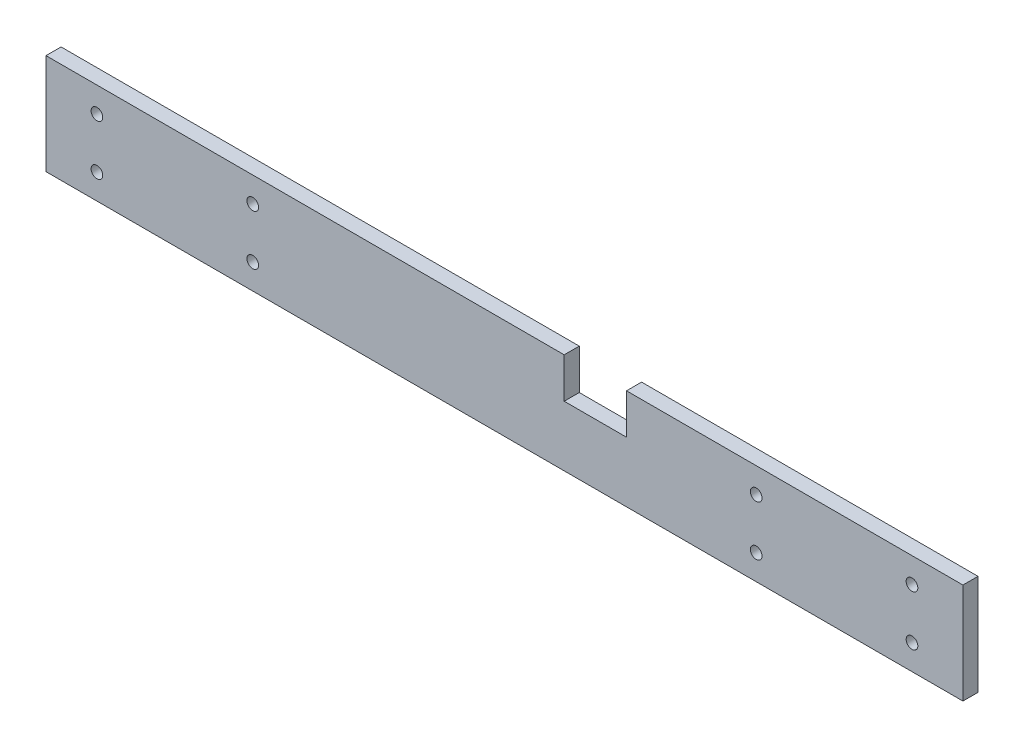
ISO-10303-21;
HEADER;
FILE_DESCRIPTION(('STEP AP214'),'2;1');
FILE_NAME('part.step','',(''),(''),'','','');
FILE_SCHEMA(('AUTOMOTIVE_DESIGN { 1 0 10303 214 1 1 1 1 }'));
ENDSEC;
DATA;
#1=APPLICATION_CONTEXT('core data for automotive mechanical design processes');
#2=APPLICATION_PROTOCOL_DEFINITION('international standard','automotive_design',2000,#1);
#3=PRODUCT_CONTEXT('',#1,'mechanical');
#4=PRODUCT('Part','Part','',(#3));
#5=PRODUCT_RELATED_PRODUCT_CATEGORY('part','',(#4));
#6=PRODUCT_DEFINITION_FORMATION('','',#4);
#7=PRODUCT_DEFINITION_CONTEXT('part definition',#1,'design');
#8=PRODUCT_DEFINITION('design','',#6,#7);
#9=PRODUCT_DEFINITION_SHAPE('','',#8);
#10=(LENGTH_UNIT() NAMED_UNIT(*) SI_UNIT(.MILLI.,.METRE.));
#11=(NAMED_UNIT(*) PLANE_ANGLE_UNIT() SI_UNIT($,.RADIAN.));
#12=(NAMED_UNIT(*) SI_UNIT($,.STERADIAN.) SOLID_ANGLE_UNIT());
#13=UNCERTAINTY_MEASURE_WITH_UNIT(LENGTH_MEASURE(1.E-05),#10,'distance_accuracy_value','');
#14=(GEOMETRIC_REPRESENTATION_CONTEXT(3) GLOBAL_UNCERTAINTY_ASSIGNED_CONTEXT((#13)) GLOBAL_UNIT_ASSIGNED_CONTEXT((#10,
#11,#12)) REPRESENTATION_CONTEXT('',''));
#15=CARTESIAN_POINT('',(0.,0.,0.));
#16=DIRECTION('',(0.,0.,1.));
#17=DIRECTION('',(1.,0.,0.));
#18=AXIS2_PLACEMENT_3D('',#15,#16,#17);
#19=CARTESIAN_POINT('',(-144.8054,15.875,-4.7625));
#20=DIRECTION('',(0.,1.,0.));
#21=DIRECTION('',(0.,0.,1.));
#22=AXIS2_PLACEMENT_3D('',#19,#20,#21);
#23=PLANE('',#22);
#24=DIRECTION('',(-1.,0.,0.));
#25=VECTOR('',#24,1.);
#26=CARTESIAN_POINT('',(-144.8054,15.875,-4.7625));
#27=LINE('',#26,#25);
#28=CARTESIAN_POINT('',(144.8054,15.875,-4.7625));
#29=VERTEX_POINT('',#28);
#30=CARTESIAN_POINT('',(38.55085,15.875,-4.7625));
#31=VERTEX_POINT('',#30);
#32=EDGE_CURVE('E184',#29,#31,#27,.T.);
#33=ORIENTED_EDGE('',*,*,#32,.T.);
#34=DIRECTION('',(0.,0.,1.));
#35=VECTOR('',#34,1.);
#36=CARTESIAN_POINT('',(38.55085,15.875,-374.946748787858));
#37=LINE('',#36,#35);
#38=CARTESIAN_POINT('',(38.55085,15.875,0.));
#39=VERTEX_POINT('',#38);
#40=EDGE_CURVE('E124',#31,#39,#37,.T.);
#41=ORIENTED_EDGE('',*,*,#40,.T.);
#42=DIRECTION('',(-1.,0.,0.));
#43=VECTOR('',#42,1.);
#44=CARTESIAN_POINT('',(-144.8054,15.875,0.));
#45=LINE('',#44,#43);
#46=CARTESIAN_POINT('',(144.8054,15.875,0.));
#47=VERTEX_POINT('',#46);
#48=EDGE_CURVE('E197',#47,#39,#45,.T.);
#49=ORIENTED_EDGE('',*,*,#48,.F.);
#50=DIRECTION('',(0.,0.,1.));
#51=VECTOR('',#50,1.);
#52=CARTESIAN_POINT('',(144.8054,15.875,-4.7625));
#53=LINE('',#52,#51);
#54=EDGE_CURVE('E193',#29,#47,#53,.T.);
#55=ORIENTED_EDGE('',*,*,#54,.F.);
#56=EDGE_LOOP('',(#33,#41,#49,#55));
#57=FACE_BOUND('',#56,.T.);
#58=ADVANCED_FACE('F38',(#57),#23,.T.);
#59=CARTESIAN_POINT('',(0.,0.,-4.7625));
#60=DIRECTION('',(0.,0.,-1.));
#61=DIRECTION('',(-1.,0.,0.));
#62=AXIS2_PLACEMENT_3D('',#59,#60,#61);
#63=PLANE('',#62);
#64=CARTESIAN_POINT('',(-128.72085,-7.93750000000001,-4.7625));
#65=DIRECTION('',(0.,0.,-1.));
#66=DIRECTION('',(-1.,0.,0.));
#67=AXIS2_PLACEMENT_3D('',#64,#65,#66);
#68=CIRCLE('',#67,1.84150000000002);
#69=CARTESIAN_POINT('',(-130.56235,-7.93750000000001,-4.7625));
#70=VERTEX_POINT('',#69);
#71=EDGE_CURVE('E153',#70,#70,#68,.T.);
#72=ORIENTED_EDGE('',*,*,#71,.F.);
#73=EDGE_LOOP('',(#72));
#74=FACE_BOUND('',#73,.T.);
#75=CARTESIAN_POINT('',(128.72085,-7.93750000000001,-4.7625));
#76=DIRECTION('',(0.,0.,-1.));
#77=DIRECTION('',(1.,0.,0.));
#78=AXIS2_PLACEMENT_3D('',#75,#76,#77);
#79=CIRCLE('',#78,1.84150000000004);
#80=CARTESIAN_POINT('',(126.87935,-7.93750000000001,-4.7625));
#81=VERTEX_POINT('',#80);
#82=EDGE_CURVE('E159',#81,#81,#79,.T.);
#83=ORIENTED_EDGE('',*,*,#82,.F.);
#84=EDGE_LOOP('',(#83));
#85=FACE_BOUND('',#84,.T.);
#86=CARTESIAN_POINT('',(128.72085,7.93749999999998,-4.7625));
#87=DIRECTION('',(0.,0.,-1.));
#88=DIRECTION('',(1.,0.,0.));
#89=AXIS2_PLACEMENT_3D('',#86,#87,#88);
#90=CIRCLE('',#89,1.84150000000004);
#91=CARTESIAN_POINT('',(126.87935,7.93749999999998,-4.7625));
#92=VERTEX_POINT('',#91);
#93=EDGE_CURVE('E165',#92,#92,#90,.T.);
#94=ORIENTED_EDGE('',*,*,#93,.F.);
#95=EDGE_LOOP('',(#94));
#96=FACE_BOUND('',#95,.T.);
#97=CARTESIAN_POINT('',(-79.5083499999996,7.93749999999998,-4.7625));
#98=DIRECTION('',(0.,0.,-1.));
#99=DIRECTION('',(-1.,0.,0.));
#100=AXIS2_PLACEMENT_3D('',#97,#98,#99);
#101=CIRCLE('',#100,1.84150000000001);
#102=CARTESIAN_POINT('',(-81.3498499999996,7.93749999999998,-4.7625));
#103=VERTEX_POINT('',#102);
#104=EDGE_CURVE('E134',#103,#103,#101,.T.);
#105=ORIENTED_EDGE('',*,*,#104,.F.);
#106=EDGE_LOOP('',(#105));
#107=FACE_BOUND('',#106,.T.);
#108=CARTESIAN_POINT('',(-79.5083499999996,-7.93750000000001,-4.7625));
#109=DIRECTION('',(0.,0.,-1.));
#110=DIRECTION('',(-1.,0.,0.));
#111=AXIS2_PLACEMENT_3D('',#108,#109,#110);
#112=CIRCLE('',#111,1.84149999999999);
#113=CARTESIAN_POINT('',(-81.3498499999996,-7.93750000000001,-4.7625));
#114=VERTEX_POINT('',#113);
#115=EDGE_CURVE('E135',#114,#114,#112,.T.);
#116=ORIENTED_EDGE('',*,*,#115,.F.);
#117=EDGE_LOOP('',(#116));
#118=FACE_BOUND('',#117,.T.);
#119=CARTESIAN_POINT('',(79.5083499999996,-7.93750000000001,-4.7625));
#120=DIRECTION('',(0.,0.,-1.));
#121=DIRECTION('',(1.,0.,0.));
#122=AXIS2_PLACEMENT_3D('',#119,#120,#121);
#123=CIRCLE('',#122,1.84149999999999);
#124=CARTESIAN_POINT('',(77.6668499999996,-7.93750000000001,-4.7625));
#125=VERTEX_POINT('',#124);
#126=EDGE_CURVE('E141',#125,#125,#123,.T.);
#127=ORIENTED_EDGE('',*,*,#126,.F.);
#128=EDGE_LOOP('',(#127));
#129=FACE_BOUND('',#128,.T.);
#130=CARTESIAN_POINT('',(79.5083499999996,7.93749999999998,-4.7625));
#131=DIRECTION('',(0.,0.,-1.));
#132=DIRECTION('',(1.,0.,0.));
#133=AXIS2_PLACEMENT_3D('',#130,#131,#132);
#134=CIRCLE('',#133,1.84150000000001);
#135=CARTESIAN_POINT('',(77.6668499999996,7.93749999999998,-4.7625));
#136=VERTEX_POINT('',#135);
#137=EDGE_CURVE('E130',#136,#136,#134,.T.);
#138=ORIENTED_EDGE('',*,*,#137,.F.);
#139=EDGE_LOOP('',(#138));
#140=FACE_BOUND('',#139,.T.);
#141=CARTESIAN_POINT('',(-128.72085,7.93749999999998,-4.7625));
#142=DIRECTION('',(0.,0.,-1.));
#143=DIRECTION('',(-1.,0.,0.));
#144=AXIS2_PLACEMENT_3D('',#141,#142,#143);
#145=CIRCLE('',#144,1.84150000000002);
#146=CARTESIAN_POINT('',(-130.56235,7.93749999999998,-4.7625));
#147=VERTEX_POINT('',#146);
#148=EDGE_CURVE('E152',#147,#147,#145,.T.);
#149=ORIENTED_EDGE('',*,*,#148,.F.);
#150=EDGE_LOOP('',(#149));
#151=FACE_BOUND('',#150,.T.);
#152=DIRECTION('',(1.,0.,0.));
#153=VECTOR('',#152,1.);
#154=CARTESIAN_POINT('',(0.,3.17499999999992,-4.7625));
#155=LINE('',#154,#153);
#156=CARTESIAN_POINT('',(18.86585,3.17499999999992,-4.7625));
#157=VERTEX_POINT('',#156);
#158=CARTESIAN_POINT('',(38.55085,3.17499999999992,-4.7625));
#159=VERTEX_POINT('',#158);
#160=EDGE_CURVE('E53',#157,#159,#155,.T.);
#161=ORIENTED_EDGE('',*,*,#160,.T.);
#162=DIRECTION('',(0.,1.,0.));
#163=VECTOR('',#162,1.);
#164=CARTESIAN_POINT('',(38.55085,0.,-4.7625));
#165=LINE('',#164,#163);
#166=EDGE_CURVE('E128',#159,#31,#165,.T.);
#167=ORIENTED_EDGE('',*,*,#166,.T.);
#168=ORIENTED_EDGE('',*,*,#32,.F.);
#169=DIRECTION('',(0.,1.,0.));
#170=VECTOR('',#169,1.);
#171=CARTESIAN_POINT('',(144.8054,-15.875,-4.7625));
#172=LINE('',#171,#170);
#173=CARTESIAN_POINT('',(144.8054,-15.875,-4.7625));
#174=VERTEX_POINT('',#173);
#175=EDGE_CURVE('E179',#174,#29,#172,.T.);
#176=ORIENTED_EDGE('',*,*,#175,.F.);
#177=DIRECTION('',(1.,0.,0.));
#178=VECTOR('',#177,1.);
#179=CARTESIAN_POINT('',(-144.8054,-15.875,-4.7625));
#180=LINE('',#179,#178);
#181=CARTESIAN_POINT('',(-144.8054,-15.875,-4.7625));
#182=VERTEX_POINT('',#181);
#183=EDGE_CURVE('E190',#182,#174,#180,.T.);
#184=ORIENTED_EDGE('',*,*,#183,.F.);
#185=DIRECTION('',(0.,-1.,0.));
#186=VECTOR('',#185,1.);
#187=CARTESIAN_POINT('',(-144.8054,-15.875,-4.7625));
#188=LINE('',#187,#186);
#189=CARTESIAN_POINT('',(-144.8054,15.875,-4.7625));
#190=VERTEX_POINT('',#189);
#191=EDGE_CURVE('E187',#190,#182,#188,.T.);
#192=ORIENTED_EDGE('',*,*,#191,.F.);
#193=CARTESIAN_POINT('',(18.86585,15.875,-4.7625));
#194=VERTEX_POINT('',#193);
#195=EDGE_CURVE('E182',#194,#190,#27,.T.);
#196=ORIENTED_EDGE('',*,*,#195,.F.);
#197=DIRECTION('',(0.,-1.,0.));
#198=VECTOR('',#197,1.);
#199=CARTESIAN_POINT('',(18.86585,0.,-4.7625));
#200=LINE('',#199,#198);
#201=EDGE_CURVE('E58',#194,#157,#200,.T.);
#202=ORIENTED_EDGE('',*,*,#201,.T.);
#203=EDGE_LOOP('',(#161,#167,#168,#176,#184,#192,#196,#202));
#204=FACE_BOUND('',#203,.T.);
#205=ADVANCED_FACE('F222',(#74,#85,#96,#107,#118,#129,#140,#151,#204),#63,.T.);
#206=CARTESIAN_POINT('',(0.,0.,0.));
#207=DIRECTION('',(0.,0.,-1.));
#208=DIRECTION('',(-1.,0.,0.));
#209=AXIS2_PLACEMENT_3D('',#206,#207,#208);
#210=PLANE('',#209);
#211=CARTESIAN_POINT('',(-128.72085,7.93749999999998,0.));
#212=DIRECTION('',(0.,0.,-1.));
#213=DIRECTION('',(-1.,0.,0.));
#214=AXIS2_PLACEMENT_3D('',#211,#212,#213);
#215=CIRCLE('',#214,1.84150000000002);
#216=CARTESIAN_POINT('',(-130.56235,7.93749999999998,0.));
#217=VERTEX_POINT('',#216);
#218=EDGE_CURVE('E173',#217,#217,#215,.T.);
#219=ORIENTED_EDGE('',*,*,#218,.T.);
#220=EDGE_LOOP('',(#219));
#221=FACE_BOUND('',#220,.T.);
#222=CARTESIAN_POINT('',(79.5083499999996,7.93749999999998,0.));
#223=DIRECTION('',(0.,0.,-1.));
#224=DIRECTION('',(1.,0.,0.));
#225=AXIS2_PLACEMENT_3D('',#222,#223,#224);
#226=CIRCLE('',#225,1.84150000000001);
#227=CARTESIAN_POINT('',(77.6668499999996,7.93749999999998,0.));
#228=VERTEX_POINT('',#227);
#229=EDGE_CURVE('E144',#228,#228,#226,.T.);
#230=ORIENTED_EDGE('',*,*,#229,.T.);
#231=EDGE_LOOP('',(#230));
#232=FACE_BOUND('',#231,.T.);
#233=CARTESIAN_POINT('',(79.5083499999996,-7.93750000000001,0.));
#234=DIRECTION('',(0.,0.,-1.));
#235=DIRECTION('',(1.,0.,0.));
#236=AXIS2_PLACEMENT_3D('',#233,#234,#235);
#237=CIRCLE('',#236,1.84149999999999);
#238=CARTESIAN_POINT('',(77.6668499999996,-7.93750000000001,0.));
#239=VERTEX_POINT('',#238);
#240=EDGE_CURVE('E138',#239,#239,#237,.T.);
#241=ORIENTED_EDGE('',*,*,#240,.T.);
#242=EDGE_LOOP('',(#241));
#243=FACE_BOUND('',#242,.T.);
#244=CARTESIAN_POINT('',(-79.5083499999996,-7.93750000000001,0.));
#245=DIRECTION('',(0.,0.,-1.));
#246=DIRECTION('',(-1.,0.,0.));
#247=AXIS2_PLACEMENT_3D('',#244,#245,#246);
#248=CIRCLE('',#247,1.84149999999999);
#249=CARTESIAN_POINT('',(-81.3498499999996,-7.93750000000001,0.));
#250=VERTEX_POINT('',#249);
#251=EDGE_CURVE('E131',#250,#250,#248,.T.);
#252=ORIENTED_EDGE('',*,*,#251,.T.);
#253=EDGE_LOOP('',(#252));
#254=FACE_BOUND('',#253,.T.);
#255=CARTESIAN_POINT('',(-79.5083499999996,7.93749999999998,0.));
#256=DIRECTION('',(0.,0.,-1.));
#257=DIRECTION('',(-1.,0.,0.));
#258=AXIS2_PLACEMENT_3D('',#255,#256,#257);
#259=CIRCLE('',#258,1.84150000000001);
#260=CARTESIAN_POINT('',(-81.3498499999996,7.93749999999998,0.));
#261=VERTEX_POINT('',#260);
#262=EDGE_CURVE('E168',#261,#261,#259,.T.);
#263=ORIENTED_EDGE('',*,*,#262,.T.);
#264=EDGE_LOOP('',(#263));
#265=FACE_BOUND('',#264,.T.);
#266=CARTESIAN_POINT('',(128.72085,7.93749999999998,0.));
#267=DIRECTION('',(0.,0.,-1.));
#268=DIRECTION('',(1.,0.,0.));
#269=AXIS2_PLACEMENT_3D('',#266,#267,#268);
#270=CIRCLE('',#269,1.84150000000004);
#271=CARTESIAN_POINT('',(126.87935,7.93749999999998,0.));
#272=VERTEX_POINT('',#271);
#273=EDGE_CURVE('E162',#272,#272,#270,.T.);
#274=ORIENTED_EDGE('',*,*,#273,.T.);
#275=EDGE_LOOP('',(#274));
#276=FACE_BOUND('',#275,.T.);
#277=CARTESIAN_POINT('',(128.72085,-7.93750000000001,0.));
#278=DIRECTION('',(0.,0.,-1.));
#279=DIRECTION('',(1.,0.,0.));
#280=AXIS2_PLACEMENT_3D('',#277,#278,#279);
#281=CIRCLE('',#280,1.84150000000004);
#282=CARTESIAN_POINT('',(126.87935,-7.93750000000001,0.));
#283=VERTEX_POINT('',#282);
#284=EDGE_CURVE('E156',#283,#283,#281,.T.);
#285=ORIENTED_EDGE('',*,*,#284,.T.);
#286=EDGE_LOOP('',(#285));
#287=FACE_BOUND('',#286,.T.);
#288=CARTESIAN_POINT('',(-128.72085,-7.93750000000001,0.));
#289=DIRECTION('',(0.,0.,-1.));
#290=DIRECTION('',(-1.,0.,0.));
#291=AXIS2_PLACEMENT_3D('',#288,#289,#290);
#292=CIRCLE('',#291,1.84150000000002);
#293=CARTESIAN_POINT('',(-130.56235,-7.93750000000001,0.));
#294=VERTEX_POINT('',#293);
#295=EDGE_CURVE('E149',#294,#294,#292,.T.);
#296=ORIENTED_EDGE('',*,*,#295,.T.);
#297=EDGE_LOOP('',(#296));
#298=FACE_BOUND('',#297,.T.);
#299=DIRECTION('',(0.,1.,0.));
#300=VECTOR('',#299,1.);
#301=CARTESIAN_POINT('',(38.55085,0.,0.));
#302=LINE('',#301,#300);
#303=CARTESIAN_POINT('',(38.55085,3.17499999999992,0.));
#304=VERTEX_POINT('',#303);
#305=EDGE_CURVE('E11',#304,#39,#302,.T.);
#306=ORIENTED_EDGE('',*,*,#305,.F.);
#307=DIRECTION('',(1.,0.,0.));
#308=VECTOR('',#307,1.);
#309=CARTESIAN_POINT('',(0.,3.17499999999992,0.));
#310=LINE('',#309,#308);
#311=CARTESIAN_POINT('',(18.86585,3.17499999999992,0.));
#312=VERTEX_POINT('',#311);
#313=EDGE_CURVE('E46',#312,#304,#310,.T.);
#314=ORIENTED_EDGE('',*,*,#313,.F.);
#315=DIRECTION('',(0.,-1.,0.));
#316=VECTOR('',#315,1.);
#317=CARTESIAN_POINT('',(18.86585,0.,0.));
#318=LINE('',#317,#316);
#319=CARTESIAN_POINT('',(18.86585,15.875,0.));
#320=VERTEX_POINT('',#319);
#321=EDGE_CURVE('E103',#320,#312,#318,.T.);
#322=ORIENTED_EDGE('',*,*,#321,.F.);
#323=CARTESIAN_POINT('',(-144.8054,15.875,0.));
#324=VERTEX_POINT('',#323);
#325=EDGE_CURVE('E196',#320,#324,#45,.T.);
#326=ORIENTED_EDGE('',*,*,#325,.T.);
#327=DIRECTION('',(0.,-1.,0.));
#328=VECTOR('',#327,1.);
#329=CARTESIAN_POINT('',(-144.8054,-15.875,0.));
#330=LINE('',#329,#328);
#331=CARTESIAN_POINT('',(-144.8054,-15.875,0.));
#332=VERTEX_POINT('',#331);
#333=EDGE_CURVE('E199',#324,#332,#330,.T.);
#334=ORIENTED_EDGE('',*,*,#333,.T.);
#335=DIRECTION('',(1.,0.,0.));
#336=VECTOR('',#335,1.);
#337=CARTESIAN_POINT('',(-144.8054,-15.875,0.));
#338=LINE('',#337,#336);
#339=CARTESIAN_POINT('',(144.8054,-15.875,0.));
#340=VERTEX_POINT('',#339);
#341=EDGE_CURVE('E183',#332,#340,#338,.T.);
#342=ORIENTED_EDGE('',*,*,#341,.T.);
#343=DIRECTION('',(0.,1.,0.));
#344=VECTOR('',#343,1.);
#345=CARTESIAN_POINT('',(144.8054,-15.875,0.));
#346=LINE('',#345,#344);
#347=EDGE_CURVE('E176',#340,#47,#346,.T.);
#348=ORIENTED_EDGE('',*,*,#347,.T.);
#349=ORIENTED_EDGE('',*,*,#48,.T.);
#350=EDGE_LOOP('',(#306,#314,#322,#326,#334,#342,#348,#349));
#351=FACE_BOUND('',#350,.T.);
#352=ADVANCED_FACE('F102',(#221,#232,#243,#254,#265,#276,#287,#298,#351),#210,.F.);
#353=CARTESIAN_POINT('',(144.8054,-15.875,-4.7625));
#354=DIRECTION('',(1.,0.,0.));
#355=DIRECTION('',(0.,0.,-1.));
#356=AXIS2_PLACEMENT_3D('',#353,#354,#355);
#357=PLANE('',#356);
#358=ORIENTED_EDGE('',*,*,#347,.F.);
#359=DIRECTION('',(0.,0.,1.));
#360=VECTOR('',#359,1.);
#361=CARTESIAN_POINT('',(144.8054,-15.875,-4.7625));
#362=LINE('',#361,#360);
#363=EDGE_CURVE('E116',#174,#340,#362,.T.);
#364=ORIENTED_EDGE('',*,*,#363,.F.);
#365=ORIENTED_EDGE('',*,*,#175,.T.);
#366=ORIENTED_EDGE('',*,*,#54,.T.);
#367=EDGE_LOOP('',(#358,#364,#365,#366));
#368=FACE_BOUND('',#367,.T.);
#369=ADVANCED_FACE('F40',(#368),#357,.T.);
#370=CARTESIAN_POINT('',(-144.8054,-15.875,-4.7625));
#371=DIRECTION('',(0.,-1.,0.));
#372=DIRECTION('',(0.,0.,-1.));
#373=AXIS2_PLACEMENT_3D('',#370,#371,#372);
#374=PLANE('',#373);
#375=ORIENTED_EDGE('',*,*,#341,.F.);
#376=DIRECTION('',(0.,0.,1.));
#377=VECTOR('',#376,1.);
#378=CARTESIAN_POINT('',(-144.8054,-15.875,-4.7625));
#379=LINE('',#378,#377);
#380=EDGE_CURVE('E205',#182,#332,#379,.T.);
#381=ORIENTED_EDGE('',*,*,#380,.F.);
#382=ORIENTED_EDGE('',*,*,#183,.T.);
#383=ORIENTED_EDGE('',*,*,#363,.T.);
#384=EDGE_LOOP('',(#375,#381,#382,#383));
#385=FACE_BOUND('',#384,.T.);
#386=ADVANCED_FACE('F220',(#385),#374,.T.);
#387=CARTESIAN_POINT('',(-144.8054,-15.875,-4.7625));
#388=DIRECTION('',(-1.,0.,0.));
#389=DIRECTION('',(0.,0.,1.));
#390=AXIS2_PLACEMENT_3D('',#387,#388,#389);
#391=PLANE('',#390);
#392=ORIENTED_EDGE('',*,*,#333,.F.);
#393=DIRECTION('',(0.,0.,1.));
#394=VECTOR('',#393,1.);
#395=CARTESIAN_POINT('',(-144.8054,15.875,-4.7625));
#396=LINE('',#395,#394);
#397=EDGE_CURVE('E207',#190,#324,#396,.T.);
#398=ORIENTED_EDGE('',*,*,#397,.F.);
#399=ORIENTED_EDGE('',*,*,#191,.T.);
#400=ORIENTED_EDGE('',*,*,#380,.T.);
#401=EDGE_LOOP('',(#392,#398,#399,#400));
#402=FACE_BOUND('',#401,.T.);
#403=ADVANCED_FACE('F248',(#402),#391,.T.);
#404=DIRECTION('',(0.,0.,1.));
#405=VECTOR('',#404,1.);
#406=CARTESIAN_POINT('',(18.86585,15.8749999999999,-374.946748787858));
#407=LINE('',#406,#405);
#408=EDGE_CURVE('E115',#194,#320,#407,.T.);
#409=ORIENTED_EDGE('',*,*,#408,.F.);
#410=ORIENTED_EDGE('',*,*,#195,.T.);
#411=ORIENTED_EDGE('',*,*,#397,.T.);
#412=ORIENTED_EDGE('',*,*,#325,.F.);
#413=EDGE_LOOP('',(#409,#410,#411,#412));
#414=FACE_BOUND('',#413,.T.);
#415=ADVANCED_FACE('F239',(#414),#23,.T.);
#416=CARTESIAN_POINT('',(-128.72085,7.93749999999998,0.));
#417=DIRECTION('',(0.,0.,-1.));
#418=DIRECTION('',(-1.,0.,0.));
#419=AXIS2_PLACEMENT_3D('',#416,#417,#418);
#420=CYLINDRICAL_SURFACE('',#419,1.84150000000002);
#421=CARTESIAN_POINT('',(-130.56235,7.93749999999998,0.));
#422=CARTESIAN_POINT('',(-130.56235,7.93749999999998,-0.049609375));
#423=CARTESIAN_POINT('',(-130.56235,7.93749999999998,-0.09921875));
#424=CARTESIAN_POINT('',(-130.56235,7.93749999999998,-0.1984375));
#425=CARTESIAN_POINT('',(-130.56235,7.93749999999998,-0.248046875));
#426=CARTESIAN_POINT('',(-130.56235,7.93749999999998,-0.347265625));
#427=CARTESIAN_POINT('',(-130.56235,7.93749999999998,-0.396875));
#428=CARTESIAN_POINT('',(-130.56235,7.93749999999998,-0.49609375));
#429=CARTESIAN_POINT('',(-130.56235,7.93749999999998,-0.545703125));
#430=CARTESIAN_POINT('',(-130.56235,7.93749999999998,-0.644921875));
#431=CARTESIAN_POINT('',(-130.56235,7.93749999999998,-0.69453125));
#432=CARTESIAN_POINT('',(-130.56235,7.93749999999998,-0.79375));
#433=CARTESIAN_POINT('',(-130.56235,7.93749999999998,-0.843359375));
#434=CARTESIAN_POINT('',(-130.56235,7.93749999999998,-0.942578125));
#435=CARTESIAN_POINT('',(-130.56235,7.93749999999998,-0.9921875));
#436=CARTESIAN_POINT('',(-130.56235,7.93749999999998,-1.09140625));
#437=CARTESIAN_POINT('',(-130.56235,7.93749999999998,-1.141015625));
#438=CARTESIAN_POINT('',(-130.56235,7.93749999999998,-1.240234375));
#439=CARTESIAN_POINT('',(-130.56235,7.93749999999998,-1.28984375));
#440=CARTESIAN_POINT('',(-130.56235,7.93749999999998,-1.3890625));
#441=CARTESIAN_POINT('',(-130.56235,7.93749999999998,-1.438671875));
#442=CARTESIAN_POINT('',(-130.56235,7.93749999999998,-1.537890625));
#443=CARTESIAN_POINT('',(-130.56235,7.93749999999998,-1.5875));
#444=CARTESIAN_POINT('',(-130.56235,7.93749999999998,-1.68671875));
#445=CARTESIAN_POINT('',(-130.56235,7.93749999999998,-1.736328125));
#446=CARTESIAN_POINT('',(-130.56235,7.93749999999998,-1.835546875));
#447=CARTESIAN_POINT('',(-130.56235,7.93749999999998,-1.88515625));
#448=CARTESIAN_POINT('',(-130.56235,7.93749999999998,-1.984375));
#449=CARTESIAN_POINT('',(-130.56235,7.93749999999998,-2.033984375));
#450=CARTESIAN_POINT('',(-130.56235,7.93749999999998,-2.133203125));
#451=CARTESIAN_POINT('',(-130.56235,7.93749999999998,-2.1828125));
#452=CARTESIAN_POINT('',(-130.56235,7.93749999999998,-2.28203125));
#453=CARTESIAN_POINT('',(-130.56235,7.93749999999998,-2.331640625));
#454=CARTESIAN_POINT('',(-130.56235,7.93749999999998,-2.430859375));
#455=CARTESIAN_POINT('',(-130.56235,7.93749999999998,-2.48046875));
#456=CARTESIAN_POINT('',(-130.56235,7.93749999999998,-2.5796875));
#457=CARTESIAN_POINT('',(-130.56235,7.93749999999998,-2.629296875));
#458=CARTESIAN_POINT('',(-130.56235,7.93749999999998,-2.728515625));
#459=CARTESIAN_POINT('',(-130.56235,7.93749999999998,-2.778125));
#460=CARTESIAN_POINT('',(-130.56235,7.93749999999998,-2.87734375));
#461=CARTESIAN_POINT('',(-130.56235,7.93749999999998,-2.926953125));
#462=CARTESIAN_POINT('',(-130.56235,7.93749999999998,-3.026171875));
#463=CARTESIAN_POINT('',(-130.56235,7.93749999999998,-3.07578125));
#464=CARTESIAN_POINT('',(-130.56235,7.93749999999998,-3.175));
#465=CARTESIAN_POINT('',(-130.56235,7.93749999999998,-3.224609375));
#466=CARTESIAN_POINT('',(-130.56235,7.93749999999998,-3.323828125));
#467=CARTESIAN_POINT('',(-130.56235,7.93749999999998,-3.3734375));
#468=CARTESIAN_POINT('',(-130.56235,7.93749999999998,-3.47265625));
#469=CARTESIAN_POINT('',(-130.56235,7.93749999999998,-3.522265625));
#470=CARTESIAN_POINT('',(-130.56235,7.93749999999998,-3.621484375));
#471=CARTESIAN_POINT('',(-130.56235,7.93749999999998,-3.67109375));
#472=CARTESIAN_POINT('',(-130.56235,7.93749999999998,-3.7703125));
#473=CARTESIAN_POINT('',(-130.56235,7.93749999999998,-3.819921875));
#474=CARTESIAN_POINT('',(-130.56235,7.93749999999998,-3.919140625));
#475=CARTESIAN_POINT('',(-130.56235,7.93749999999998,-3.96875));
#476=CARTESIAN_POINT('',(-130.56235,7.93749999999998,-4.06796875));
#477=CARTESIAN_POINT('',(-130.56235,7.93749999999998,-4.117578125));
#478=CARTESIAN_POINT('',(-130.56235,7.93749999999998,-4.216796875));
#479=CARTESIAN_POINT('',(-130.56235,7.93749999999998,-4.26640625));
#480=CARTESIAN_POINT('',(-130.56235,7.93749999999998,-4.365625));
#481=CARTESIAN_POINT('',(-130.56235,7.93749999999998,-4.415234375));
#482=CARTESIAN_POINT('',(-130.56235,7.93749999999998,-4.514453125));
#483=CARTESIAN_POINT('',(-130.56235,7.93749999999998,-4.5640625));
#484=CARTESIAN_POINT('',(-130.56235,7.93749999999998,-4.66328125));
#485=CARTESIAN_POINT('',(-130.56235,7.93749999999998,-4.712890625));
#486=CARTESIAN_POINT('',(-130.56235,7.93749999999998,-4.7625));
#487=B_SPLINE_CURVE_WITH_KNOTS('',3,(#421,#422,#423,#424,#425,#426,#427,#428,#429,#430,#431,
#432,#433,#434,#435,#436,#437,#438,#439,#440,#441,#442,#443,#444,#445,#446,#447,#448,#449,#450,
#451,#452,#453,#454,#455,#456,#457,#458,#459,#460,#461,#462,#463,#464,#465,#466,#467,#468,#469,
#470,#471,#472,#473,#474,#475,#476,#477,#478,#479,#480,#481,#482,#483,#484,#485,#486),
.UNSPECIFIED.,.F.,.F.,(4,2,2,2,2,2,2,2,2,2,2,2,2,2,2,2,2,2,2,2,2,2,2,2,2,2,2,2,2,2,2,2,4),(0.,
0.148828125,0.29765625,0.446484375,0.5953125,0.744140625,0.89296875,1.041796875,1.190625,
1.339453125,1.48828125,1.637109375,1.7859375,1.934765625,2.08359375,2.232421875,2.38125,
2.530078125,2.67890625,2.827734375,2.9765625,3.125390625,3.27421875,3.423046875,3.571875,
3.720703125,3.86953125,4.018359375,4.1671875,4.316015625,4.46484375,4.613671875,4.7625),.UNSPECIFIED.);
#488=EDGE_CURVE('BSEAM247',#217,#147,#487,.T.);
#489=ORIENTED_EDGE('',*,*,#218,.F.);
#490=ORIENTED_EDGE('',*,*,#148,.T.);
#491=ORIENTED_EDGE('',*,*,#488,.T.);
#492=ORIENTED_EDGE('',*,*,#488,.F.);
#493=EDGE_LOOP('',(#489,#491,#490,#492));
#494=FACE_BOUND('',#493,.T.);
#495=ADVANCED_FACE('F247',(#494),#420,.F.);
#496=CARTESIAN_POINT('',(79.5083499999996,7.93749999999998,0.));
#497=DIRECTION('',(0.,0.,-1.));
#498=DIRECTION('',(-1.,0.,0.));
#499=AXIS2_PLACEMENT_3D('',#496,#497,#498);
#500=CYLINDRICAL_SURFACE('',#499,1.84150000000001);
#501=CARTESIAN_POINT('',(77.6668499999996,7.93749999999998,0.));
#502=CARTESIAN_POINT('',(77.6668499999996,7.93749999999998,-0.049609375));
#503=CARTESIAN_POINT('',(77.6668499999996,7.93749999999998,-0.09921875));
#504=CARTESIAN_POINT('',(77.6668499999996,7.93749999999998,-0.1984375));
#505=CARTESIAN_POINT('',(77.6668499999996,7.93749999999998,-0.248046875));
#506=CARTESIAN_POINT('',(77.6668499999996,7.93749999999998,-0.347265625));
#507=CARTESIAN_POINT('',(77.6668499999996,7.93749999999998,-0.396875));
#508=CARTESIAN_POINT('',(77.6668499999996,7.93749999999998,-0.49609375));
#509=CARTESIAN_POINT('',(77.6668499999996,7.93749999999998,-0.545703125));
#510=CARTESIAN_POINT('',(77.6668499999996,7.93749999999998,-0.644921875));
#511=CARTESIAN_POINT('',(77.6668499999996,7.93749999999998,-0.69453125));
#512=CARTESIAN_POINT('',(77.6668499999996,7.93749999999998,-0.79375));
#513=CARTESIAN_POINT('',(77.6668499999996,7.93749999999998,-0.843359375));
#514=CARTESIAN_POINT('',(77.6668499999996,7.93749999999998,-0.942578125));
#515=CARTESIAN_POINT('',(77.6668499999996,7.93749999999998,-0.9921875));
#516=CARTESIAN_POINT('',(77.6668499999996,7.93749999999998,-1.09140625));
#517=CARTESIAN_POINT('',(77.6668499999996,7.93749999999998,-1.141015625));
#518=CARTESIAN_POINT('',(77.6668499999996,7.93749999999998,-1.240234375));
#519=CARTESIAN_POINT('',(77.6668499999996,7.93749999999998,-1.28984375));
#520=CARTESIAN_POINT('',(77.6668499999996,7.93749999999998,-1.3890625));
#521=CARTESIAN_POINT('',(77.6668499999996,7.93749999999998,-1.438671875));
#522=CARTESIAN_POINT('',(77.6668499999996,7.93749999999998,-1.537890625));
#523=CARTESIAN_POINT('',(77.6668499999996,7.93749999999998,-1.5875));
#524=CARTESIAN_POINT('',(77.6668499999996,7.93749999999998,-1.68671875));
#525=CARTESIAN_POINT('',(77.6668499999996,7.93749999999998,-1.736328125));
#526=CARTESIAN_POINT('',(77.6668499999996,7.93749999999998,-1.835546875));
#527=CARTESIAN_POINT('',(77.6668499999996,7.93749999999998,-1.88515625));
#528=CARTESIAN_POINT('',(77.6668499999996,7.93749999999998,-1.984375));
#529=CARTESIAN_POINT('',(77.6668499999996,7.93749999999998,-2.033984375));
#530=CARTESIAN_POINT('',(77.6668499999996,7.93749999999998,-2.133203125));
#531=CARTESIAN_POINT('',(77.6668499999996,7.93749999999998,-2.1828125));
#532=CARTESIAN_POINT('',(77.6668499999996,7.93749999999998,-2.28203125));
#533=CARTESIAN_POINT('',(77.6668499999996,7.93749999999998,-2.331640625));
#534=CARTESIAN_POINT('',(77.6668499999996,7.93749999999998,-2.430859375));
#535=CARTESIAN_POINT('',(77.6668499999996,7.93749999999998,-2.48046875));
#536=CARTESIAN_POINT('',(77.6668499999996,7.93749999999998,-2.5796875));
#537=CARTESIAN_POINT('',(77.6668499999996,7.93749999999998,-2.629296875));
#538=CARTESIAN_POINT('',(77.6668499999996,7.93749999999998,-2.728515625));
#539=CARTESIAN_POINT('',(77.6668499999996,7.93749999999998,-2.778125));
#540=CARTESIAN_POINT('',(77.6668499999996,7.93749999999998,-2.87734375));
#541=CARTESIAN_POINT('',(77.6668499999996,7.93749999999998,-2.926953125));
#542=CARTESIAN_POINT('',(77.6668499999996,7.93749999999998,-3.026171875));
#543=CARTESIAN_POINT('',(77.6668499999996,7.93749999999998,-3.07578125));
#544=CARTESIAN_POINT('',(77.6668499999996,7.93749999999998,-3.175));
#545=CARTESIAN_POINT('',(77.6668499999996,7.93749999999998,-3.224609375));
#546=CARTESIAN_POINT('',(77.6668499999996,7.93749999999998,-3.323828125));
#547=CARTESIAN_POINT('',(77.6668499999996,7.93749999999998,-3.3734375));
#548=CARTESIAN_POINT('',(77.6668499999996,7.93749999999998,-3.47265625));
#549=CARTESIAN_POINT('',(77.6668499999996,7.93749999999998,-3.522265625));
#550=CARTESIAN_POINT('',(77.6668499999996,7.93749999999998,-3.621484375));
#551=CARTESIAN_POINT('',(77.6668499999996,7.93749999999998,-3.67109375));
#552=CARTESIAN_POINT('',(77.6668499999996,7.93749999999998,-3.7703125));
#553=CARTESIAN_POINT('',(77.6668499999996,7.93749999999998,-3.819921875));
#554=CARTESIAN_POINT('',(77.6668499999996,7.93749999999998,-3.919140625));
#555=CARTESIAN_POINT('',(77.6668499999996,7.93749999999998,-3.96875));
#556=CARTESIAN_POINT('',(77.6668499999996,7.93749999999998,-4.06796875));
#557=CARTESIAN_POINT('',(77.6668499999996,7.93749999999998,-4.117578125));
#558=CARTESIAN_POINT('',(77.6668499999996,7.93749999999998,-4.216796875));
#559=CARTESIAN_POINT('',(77.6668499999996,7.93749999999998,-4.26640625));
#560=CARTESIAN_POINT('',(77.6668499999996,7.93749999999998,-4.365625));
#561=CARTESIAN_POINT('',(77.6668499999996,7.93749999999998,-4.415234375));
#562=CARTESIAN_POINT('',(77.6668499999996,7.93749999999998,-4.514453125));
#563=CARTESIAN_POINT('',(77.6668499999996,7.93749999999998,-4.5640625));
#564=CARTESIAN_POINT('',(77.6668499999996,7.93749999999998,-4.66328125));
#565=CARTESIAN_POINT('',(77.6668499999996,7.93749999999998,-4.712890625));
#566=CARTESIAN_POINT('',(77.6668499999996,7.93749999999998,-4.7625));
#567=B_SPLINE_CURVE_WITH_KNOTS('',3,(#501,#502,#503,#504,#505,#506,#507,#508,#509,#510,#511,
#512,#513,#514,#515,#516,#517,#518,#519,#520,#521,#522,#523,#524,#525,#526,#527,#528,#529,#530,
#531,#532,#533,#534,#535,#536,#537,#538,#539,#540,#541,#542,#543,#544,#545,#546,#547,#548,#549,
#550,#551,#552,#553,#554,#555,#556,#557,#558,#559,#560,#561,#562,#563,#564,#565,#566),
.UNSPECIFIED.,.F.,.F.,(4,2,2,2,2,2,2,2,2,2,2,2,2,2,2,2,2,2,2,2,2,2,2,2,2,2,2,2,2,2,2,2,4),(0.,
0.148828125,0.29765625,0.446484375,0.5953125,0.744140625,0.89296875,1.041796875,1.190625,
1.339453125,1.48828125,1.637109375,1.7859375,1.934765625,2.08359375,2.232421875,2.38125,
2.530078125,2.67890625,2.827734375,2.9765625,3.125390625,3.27421875,3.423046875,3.571875,
3.720703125,3.86953125,4.018359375,4.1671875,4.316015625,4.46484375,4.613671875,4.7625),.UNSPECIFIED.);
#568=EDGE_CURVE('BSEAM254',#228,#136,#567,.T.);
#569=ORIENTED_EDGE('',*,*,#229,.F.);
#570=ORIENTED_EDGE('',*,*,#137,.T.);
#571=ORIENTED_EDGE('',*,*,#568,.T.);
#572=ORIENTED_EDGE('',*,*,#568,.F.);
#573=EDGE_LOOP('',(#569,#571,#570,#572));
#574=FACE_BOUND('',#573,.T.);
#575=ADVANCED_FACE('F254',(#574),#500,.F.);
#576=CARTESIAN_POINT('',(79.5083499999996,-7.93750000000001,0.));
#577=DIRECTION('',(0.,0.,-1.));
#578=DIRECTION('',(-1.,0.,0.));
#579=AXIS2_PLACEMENT_3D('',#576,#577,#578);
#580=CYLINDRICAL_SURFACE('',#579,1.84149999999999);
#581=CARTESIAN_POINT('',(77.6668499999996,-7.93750000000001,0.));
#582=CARTESIAN_POINT('',(77.6668499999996,-7.93750000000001,-0.049609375));
#583=CARTESIAN_POINT('',(77.6668499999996,-7.93750000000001,-0.09921875));
#584=CARTESIAN_POINT('',(77.6668499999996,-7.93750000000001,-0.1984375));
#585=CARTESIAN_POINT('',(77.6668499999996,-7.93750000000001,-0.248046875));
#586=CARTESIAN_POINT('',(77.6668499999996,-7.93750000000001,-0.347265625));
#587=CARTESIAN_POINT('',(77.6668499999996,-7.93750000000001,-0.396875));
#588=CARTESIAN_POINT('',(77.6668499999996,-7.93750000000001,-0.49609375));
#589=CARTESIAN_POINT('',(77.6668499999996,-7.93750000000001,-0.545703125));
#590=CARTESIAN_POINT('',(77.6668499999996,-7.93750000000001,-0.644921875));
#591=CARTESIAN_POINT('',(77.6668499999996,-7.93750000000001,-0.69453125));
#592=CARTESIAN_POINT('',(77.6668499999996,-7.93750000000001,-0.79375));
#593=CARTESIAN_POINT('',(77.6668499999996,-7.93750000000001,-0.843359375));
#594=CARTESIAN_POINT('',(77.6668499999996,-7.93750000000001,-0.942578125));
#595=CARTESIAN_POINT('',(77.6668499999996,-7.93750000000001,-0.9921875));
#596=CARTESIAN_POINT('',(77.6668499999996,-7.93750000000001,-1.09140625));
#597=CARTESIAN_POINT('',(77.6668499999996,-7.93750000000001,-1.141015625));
#598=CARTESIAN_POINT('',(77.6668499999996,-7.93750000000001,-1.240234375));
#599=CARTESIAN_POINT('',(77.6668499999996,-7.93750000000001,-1.28984375));
#600=CARTESIAN_POINT('',(77.6668499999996,-7.93750000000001,-1.3890625));
#601=CARTESIAN_POINT('',(77.6668499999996,-7.93750000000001,-1.438671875));
#602=CARTESIAN_POINT('',(77.6668499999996,-7.93750000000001,-1.537890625));
#603=CARTESIAN_POINT('',(77.6668499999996,-7.93750000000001,-1.5875));
#604=CARTESIAN_POINT('',(77.6668499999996,-7.93750000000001,-1.68671875));
#605=CARTESIAN_POINT('',(77.6668499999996,-7.93750000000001,-1.736328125));
#606=CARTESIAN_POINT('',(77.6668499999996,-7.93750000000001,-1.835546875));
#607=CARTESIAN_POINT('',(77.6668499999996,-7.93750000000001,-1.88515625));
#608=CARTESIAN_POINT('',(77.6668499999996,-7.93750000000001,-1.984375));
#609=CARTESIAN_POINT('',(77.6668499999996,-7.93750000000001,-2.033984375));
#610=CARTESIAN_POINT('',(77.6668499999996,-7.93750000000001,-2.133203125));
#611=CARTESIAN_POINT('',(77.6668499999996,-7.93750000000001,-2.1828125));
#612=CARTESIAN_POINT('',(77.6668499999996,-7.93750000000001,-2.28203125));
#613=CARTESIAN_POINT('',(77.6668499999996,-7.93750000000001,-2.331640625));
#614=CARTESIAN_POINT('',(77.6668499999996,-7.93750000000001,-2.430859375));
#615=CARTESIAN_POINT('',(77.6668499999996,-7.93750000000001,-2.48046875));
#616=CARTESIAN_POINT('',(77.6668499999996,-7.93750000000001,-2.5796875));
#617=CARTESIAN_POINT('',(77.6668499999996,-7.93750000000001,-2.629296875));
#618=CARTESIAN_POINT('',(77.6668499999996,-7.93750000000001,-2.728515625));
#619=CARTESIAN_POINT('',(77.6668499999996,-7.93750000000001,-2.778125));
#620=CARTESIAN_POINT('',(77.6668499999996,-7.93750000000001,-2.87734375));
#621=CARTESIAN_POINT('',(77.6668499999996,-7.93750000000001,-2.926953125));
#622=CARTESIAN_POINT('',(77.6668499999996,-7.93750000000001,-3.026171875));
#623=CARTESIAN_POINT('',(77.6668499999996,-7.93750000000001,-3.07578125));
#624=CARTESIAN_POINT('',(77.6668499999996,-7.93750000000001,-3.175));
#625=CARTESIAN_POINT('',(77.6668499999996,-7.93750000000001,-3.224609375));
#626=CARTESIAN_POINT('',(77.6668499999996,-7.93750000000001,-3.323828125));
#627=CARTESIAN_POINT('',(77.6668499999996,-7.93750000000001,-3.3734375));
#628=CARTESIAN_POINT('',(77.6668499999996,-7.93750000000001,-3.47265625));
#629=CARTESIAN_POINT('',(77.6668499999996,-7.93750000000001,-3.522265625));
#630=CARTESIAN_POINT('',(77.6668499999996,-7.93750000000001,-3.621484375));
#631=CARTESIAN_POINT('',(77.6668499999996,-7.93750000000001,-3.67109375));
#632=CARTESIAN_POINT('',(77.6668499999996,-7.93750000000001,-3.7703125));
#633=CARTESIAN_POINT('',(77.6668499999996,-7.93750000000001,-3.819921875));
#634=CARTESIAN_POINT('',(77.6668499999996,-7.93750000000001,-3.919140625));
#635=CARTESIAN_POINT('',(77.6668499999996,-7.93750000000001,-3.96875));
#636=CARTESIAN_POINT('',(77.6668499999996,-7.93750000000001,-4.06796875));
#637=CARTESIAN_POINT('',(77.6668499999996,-7.93750000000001,-4.117578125));
#638=CARTESIAN_POINT('',(77.6668499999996,-7.93750000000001,-4.216796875));
#639=CARTESIAN_POINT('',(77.6668499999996,-7.93750000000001,-4.26640625));
#640=CARTESIAN_POINT('',(77.6668499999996,-7.93750000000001,-4.365625));
#641=CARTESIAN_POINT('',(77.6668499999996,-7.93750000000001,-4.415234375));
#642=CARTESIAN_POINT('',(77.6668499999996,-7.93750000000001,-4.514453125));
#643=CARTESIAN_POINT('',(77.6668499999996,-7.93750000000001,-4.5640625));
#644=CARTESIAN_POINT('',(77.6668499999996,-7.93750000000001,-4.66328125));
#645=CARTESIAN_POINT('',(77.6668499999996,-7.93750000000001,-4.712890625));
#646=CARTESIAN_POINT('',(77.6668499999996,-7.93750000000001,-4.7625));
#647=B_SPLINE_CURVE_WITH_KNOTS('',3,(#581,#582,#583,#584,#585,#586,#587,#588,#589,#590,#591,
#592,#593,#594,#595,#596,#597,#598,#599,#600,#601,#602,#603,#604,#605,#606,#607,#608,#609,#610,
#611,#612,#613,#614,#615,#616,#617,#618,#619,#620,#621,#622,#623,#624,#625,#626,#627,#628,#629,
#630,#631,#632,#633,#634,#635,#636,#637,#638,#639,#640,#641,#642,#643,#644,#645,#646),
.UNSPECIFIED.,.F.,.F.,(4,2,2,2,2,2,2,2,2,2,2,2,2,2,2,2,2,2,2,2,2,2,2,2,2,2,2,2,2,2,2,2,4),(0.,
0.148828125,0.29765625,0.446484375,0.5953125,0.744140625,0.89296875,1.041796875,1.190625,
1.339453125,1.48828125,1.637109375,1.7859375,1.934765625,2.08359375,2.232421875,2.38125,
2.530078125,2.67890625,2.827734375,2.9765625,3.125390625,3.27421875,3.423046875,3.571875,
3.720703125,3.86953125,4.018359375,4.1671875,4.316015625,4.46484375,4.613671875,4.7625),.UNSPECIFIED.);
#648=EDGE_CURVE('BSEAM281',#239,#125,#647,.T.);
#649=ORIENTED_EDGE('',*,*,#240,.F.);
#650=ORIENTED_EDGE('',*,*,#126,.T.);
#651=ORIENTED_EDGE('',*,*,#648,.T.);
#652=ORIENTED_EDGE('',*,*,#648,.F.);
#653=EDGE_LOOP('',(#649,#651,#650,#652));
#654=FACE_BOUND('',#653,.T.);
#655=ADVANCED_FACE('F281',(#654),#580,.F.);
#656=CARTESIAN_POINT('',(-79.5083499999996,-7.93750000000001,0.));
#657=DIRECTION('',(0.,0.,-1.));
#658=DIRECTION('',(-1.,0.,0.));
#659=AXIS2_PLACEMENT_3D('',#656,#657,#658);
#660=CYLINDRICAL_SURFACE('',#659,1.84149999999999);
#661=CARTESIAN_POINT('',(-81.3498499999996,-7.93750000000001,0.));
#662=CARTESIAN_POINT('',(-81.3498499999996,-7.93750000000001,-0.049609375));
#663=CARTESIAN_POINT('',(-81.3498499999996,-7.93750000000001,-0.09921875));
#664=CARTESIAN_POINT('',(-81.3498499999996,-7.93750000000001,-0.1984375));
#665=CARTESIAN_POINT('',(-81.3498499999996,-7.93750000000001,-0.248046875));
#666=CARTESIAN_POINT('',(-81.3498499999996,-7.93750000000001,-0.347265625));
#667=CARTESIAN_POINT('',(-81.3498499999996,-7.93750000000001,-0.396875));
#668=CARTESIAN_POINT('',(-81.3498499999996,-7.93750000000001,-0.49609375));
#669=CARTESIAN_POINT('',(-81.3498499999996,-7.93750000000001,-0.545703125));
#670=CARTESIAN_POINT('',(-81.3498499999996,-7.93750000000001,-0.644921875));
#671=CARTESIAN_POINT('',(-81.3498499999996,-7.93750000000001,-0.69453125));
#672=CARTESIAN_POINT('',(-81.3498499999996,-7.93750000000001,-0.79375));
#673=CARTESIAN_POINT('',(-81.3498499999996,-7.93750000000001,-0.843359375));
#674=CARTESIAN_POINT('',(-81.3498499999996,-7.93750000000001,-0.942578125));
#675=CARTESIAN_POINT('',(-81.3498499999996,-7.93750000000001,-0.9921875));
#676=CARTESIAN_POINT('',(-81.3498499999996,-7.93750000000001,-1.09140625));
#677=CARTESIAN_POINT('',(-81.3498499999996,-7.93750000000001,-1.141015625));
#678=CARTESIAN_POINT('',(-81.3498499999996,-7.93750000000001,-1.240234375));
#679=CARTESIAN_POINT('',(-81.3498499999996,-7.93750000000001,-1.28984375));
#680=CARTESIAN_POINT('',(-81.3498499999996,-7.93750000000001,-1.3890625));
#681=CARTESIAN_POINT('',(-81.3498499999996,-7.93750000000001,-1.438671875));
#682=CARTESIAN_POINT('',(-81.3498499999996,-7.93750000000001,-1.537890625));
#683=CARTESIAN_POINT('',(-81.3498499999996,-7.93750000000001,-1.5875));
#684=CARTESIAN_POINT('',(-81.3498499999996,-7.93750000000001,-1.68671875));
#685=CARTESIAN_POINT('',(-81.3498499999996,-7.93750000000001,-1.736328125));
#686=CARTESIAN_POINT('',(-81.3498499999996,-7.93750000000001,-1.835546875));
#687=CARTESIAN_POINT('',(-81.3498499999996,-7.93750000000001,-1.88515625));
#688=CARTESIAN_POINT('',(-81.3498499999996,-7.93750000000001,-1.984375));
#689=CARTESIAN_POINT('',(-81.3498499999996,-7.93750000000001,-2.033984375));
#690=CARTESIAN_POINT('',(-81.3498499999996,-7.93750000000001,-2.133203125));
#691=CARTESIAN_POINT('',(-81.3498499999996,-7.93750000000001,-2.1828125));
#692=CARTESIAN_POINT('',(-81.3498499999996,-7.93750000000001,-2.28203125));
#693=CARTESIAN_POINT('',(-81.3498499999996,-7.93750000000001,-2.331640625));
#694=CARTESIAN_POINT('',(-81.3498499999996,-7.93750000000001,-2.430859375));
#695=CARTESIAN_POINT('',(-81.3498499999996,-7.93750000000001,-2.48046875));
#696=CARTESIAN_POINT('',(-81.3498499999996,-7.93750000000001,-2.5796875));
#697=CARTESIAN_POINT('',(-81.3498499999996,-7.93750000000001,-2.629296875));
#698=CARTESIAN_POINT('',(-81.3498499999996,-7.93750000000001,-2.728515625));
#699=CARTESIAN_POINT('',(-81.3498499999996,-7.93750000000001,-2.778125));
#700=CARTESIAN_POINT('',(-81.3498499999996,-7.93750000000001,-2.87734375));
#701=CARTESIAN_POINT('',(-81.3498499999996,-7.93750000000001,-2.926953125));
#702=CARTESIAN_POINT('',(-81.3498499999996,-7.93750000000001,-3.026171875));
#703=CARTESIAN_POINT('',(-81.3498499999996,-7.93750000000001,-3.07578125));
#704=CARTESIAN_POINT('',(-81.3498499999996,-7.93750000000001,-3.175));
#705=CARTESIAN_POINT('',(-81.3498499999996,-7.93750000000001,-3.224609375));
#706=CARTESIAN_POINT('',(-81.3498499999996,-7.93750000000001,-3.323828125));
#707=CARTESIAN_POINT('',(-81.3498499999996,-7.93750000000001,-3.3734375));
#708=CARTESIAN_POINT('',(-81.3498499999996,-7.93750000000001,-3.47265625));
#709=CARTESIAN_POINT('',(-81.3498499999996,-7.93750000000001,-3.522265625));
#710=CARTESIAN_POINT('',(-81.3498499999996,-7.93750000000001,-3.621484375));
#711=CARTESIAN_POINT('',(-81.3498499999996,-7.93750000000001,-3.67109375));
#712=CARTESIAN_POINT('',(-81.3498499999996,-7.93750000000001,-3.7703125));
#713=CARTESIAN_POINT('',(-81.3498499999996,-7.93750000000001,-3.819921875));
#714=CARTESIAN_POINT('',(-81.3498499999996,-7.93750000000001,-3.919140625));
#715=CARTESIAN_POINT('',(-81.3498499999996,-7.93750000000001,-3.96875));
#716=CARTESIAN_POINT('',(-81.3498499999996,-7.93750000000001,-4.06796875));
#717=CARTESIAN_POINT('',(-81.3498499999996,-7.93750000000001,-4.117578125));
#718=CARTESIAN_POINT('',(-81.3498499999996,-7.93750000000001,-4.216796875));
#719=CARTESIAN_POINT('',(-81.3498499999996,-7.93750000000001,-4.26640625));
#720=CARTESIAN_POINT('',(-81.3498499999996,-7.93750000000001,-4.365625));
#721=CARTESIAN_POINT('',(-81.3498499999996,-7.93750000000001,-4.415234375));
#722=CARTESIAN_POINT('',(-81.3498499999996,-7.93750000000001,-4.514453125));
#723=CARTESIAN_POINT('',(-81.3498499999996,-7.93750000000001,-4.5640625));
#724=CARTESIAN_POINT('',(-81.3498499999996,-7.93750000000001,-4.66328125));
#725=CARTESIAN_POINT('',(-81.3498499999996,-7.93750000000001,-4.712890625));
#726=CARTESIAN_POINT('',(-81.3498499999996,-7.93750000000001,-4.7625));
#727=B_SPLINE_CURVE_WITH_KNOTS('',3,(#661,#662,#663,#664,#665,#666,#667,#668,#669,#670,#671,
#672,#673,#674,#675,#676,#677,#678,#679,#680,#681,#682,#683,#684,#685,#686,#687,#688,#689,#690,
#691,#692,#693,#694,#695,#696,#697,#698,#699,#700,#701,#702,#703,#704,#705,#706,#707,#708,#709,
#710,#711,#712,#713,#714,#715,#716,#717,#718,#719,#720,#721,#722,#723,#724,#725,#726),
.UNSPECIFIED.,.F.,.F.,(4,2,2,2,2,2,2,2,2,2,2,2,2,2,2,2,2,2,2,2,2,2,2,2,2,2,2,2,2,2,2,2,4),(0.,
0.148828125,0.29765625,0.446484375,0.5953125,0.744140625,0.89296875,1.041796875,1.190625,
1.339453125,1.48828125,1.637109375,1.7859375,1.934765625,2.08359375,2.232421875,2.38125,
2.530078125,2.67890625,2.827734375,2.9765625,3.125390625,3.27421875,3.423046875,3.571875,
3.720703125,3.86953125,4.018359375,4.1671875,4.316015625,4.46484375,4.613671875,4.7625),.UNSPECIFIED.);
#728=EDGE_CURVE('BSEAM271',#250,#114,#727,.T.);
#729=ORIENTED_EDGE('',*,*,#251,.F.);
#730=ORIENTED_EDGE('',*,*,#115,.T.);
#731=ORIENTED_EDGE('',*,*,#728,.T.);
#732=ORIENTED_EDGE('',*,*,#728,.F.);
#733=EDGE_LOOP('',(#729,#731,#730,#732));
#734=FACE_BOUND('',#733,.T.);
#735=ADVANCED_FACE('F271',(#734),#660,.F.);
#736=CARTESIAN_POINT('',(-79.5083499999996,7.93749999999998,0.));
#737=DIRECTION('',(0.,0.,-1.));
#738=DIRECTION('',(-1.,0.,0.));
#739=AXIS2_PLACEMENT_3D('',#736,#737,#738);
#740=CYLINDRICAL_SURFACE('',#739,1.84150000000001);
#741=CARTESIAN_POINT('',(-81.3498499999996,7.93749999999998,0.));
#742=CARTESIAN_POINT('',(-81.3498499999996,7.93749999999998,-0.049609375));
#743=CARTESIAN_POINT('',(-81.3498499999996,7.93749999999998,-0.09921875));
#744=CARTESIAN_POINT('',(-81.3498499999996,7.93749999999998,-0.1984375));
#745=CARTESIAN_POINT('',(-81.3498499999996,7.93749999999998,-0.248046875));
#746=CARTESIAN_POINT('',(-81.3498499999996,7.93749999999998,-0.347265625));
#747=CARTESIAN_POINT('',(-81.3498499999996,7.93749999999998,-0.396875));
#748=CARTESIAN_POINT('',(-81.3498499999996,7.93749999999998,-0.49609375));
#749=CARTESIAN_POINT('',(-81.3498499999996,7.93749999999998,-0.545703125));
#750=CARTESIAN_POINT('',(-81.3498499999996,7.93749999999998,-0.644921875));
#751=CARTESIAN_POINT('',(-81.3498499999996,7.93749999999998,-0.69453125));
#752=CARTESIAN_POINT('',(-81.3498499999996,7.93749999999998,-0.79375));
#753=CARTESIAN_POINT('',(-81.3498499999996,7.93749999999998,-0.843359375));
#754=CARTESIAN_POINT('',(-81.3498499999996,7.93749999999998,-0.942578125));
#755=CARTESIAN_POINT('',(-81.3498499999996,7.93749999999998,-0.9921875));
#756=CARTESIAN_POINT('',(-81.3498499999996,7.93749999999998,-1.09140625));
#757=CARTESIAN_POINT('',(-81.3498499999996,7.93749999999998,-1.141015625));
#758=CARTESIAN_POINT('',(-81.3498499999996,7.93749999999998,-1.240234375));
#759=CARTESIAN_POINT('',(-81.3498499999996,7.93749999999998,-1.28984375));
#760=CARTESIAN_POINT('',(-81.3498499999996,7.93749999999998,-1.3890625));
#761=CARTESIAN_POINT('',(-81.3498499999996,7.93749999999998,-1.438671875));
#762=CARTESIAN_POINT('',(-81.3498499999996,7.93749999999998,-1.537890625));
#763=CARTESIAN_POINT('',(-81.3498499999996,7.93749999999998,-1.5875));
#764=CARTESIAN_POINT('',(-81.3498499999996,7.93749999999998,-1.68671875));
#765=CARTESIAN_POINT('',(-81.3498499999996,7.93749999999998,-1.736328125));
#766=CARTESIAN_POINT('',(-81.3498499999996,7.93749999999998,-1.835546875));
#767=CARTESIAN_POINT('',(-81.3498499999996,7.93749999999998,-1.88515625));
#768=CARTESIAN_POINT('',(-81.3498499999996,7.93749999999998,-1.984375));
#769=CARTESIAN_POINT('',(-81.3498499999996,7.93749999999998,-2.033984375));
#770=CARTESIAN_POINT('',(-81.3498499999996,7.93749999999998,-2.133203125));
#771=CARTESIAN_POINT('',(-81.3498499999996,7.93749999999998,-2.1828125));
#772=CARTESIAN_POINT('',(-81.3498499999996,7.93749999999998,-2.28203125));
#773=CARTESIAN_POINT('',(-81.3498499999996,7.93749999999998,-2.331640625));
#774=CARTESIAN_POINT('',(-81.3498499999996,7.93749999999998,-2.430859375));
#775=CARTESIAN_POINT('',(-81.3498499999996,7.93749999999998,-2.48046875));
#776=CARTESIAN_POINT('',(-81.3498499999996,7.93749999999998,-2.5796875));
#777=CARTESIAN_POINT('',(-81.3498499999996,7.93749999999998,-2.629296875));
#778=CARTESIAN_POINT('',(-81.3498499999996,7.93749999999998,-2.728515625));
#779=CARTESIAN_POINT('',(-81.3498499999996,7.93749999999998,-2.778125));
#780=CARTESIAN_POINT('',(-81.3498499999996,7.93749999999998,-2.87734375));
#781=CARTESIAN_POINT('',(-81.3498499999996,7.93749999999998,-2.926953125));
#782=CARTESIAN_POINT('',(-81.3498499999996,7.93749999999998,-3.026171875));
#783=CARTESIAN_POINT('',(-81.3498499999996,7.93749999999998,-3.07578125));
#784=CARTESIAN_POINT('',(-81.3498499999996,7.93749999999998,-3.175));
#785=CARTESIAN_POINT('',(-81.3498499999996,7.93749999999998,-3.224609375));
#786=CARTESIAN_POINT('',(-81.3498499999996,7.93749999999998,-3.323828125));
#787=CARTESIAN_POINT('',(-81.3498499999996,7.93749999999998,-3.3734375));
#788=CARTESIAN_POINT('',(-81.3498499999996,7.93749999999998,-3.47265625));
#789=CARTESIAN_POINT('',(-81.3498499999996,7.93749999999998,-3.522265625));
#790=CARTESIAN_POINT('',(-81.3498499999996,7.93749999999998,-3.621484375));
#791=CARTESIAN_POINT('',(-81.3498499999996,7.93749999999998,-3.67109375));
#792=CARTESIAN_POINT('',(-81.3498499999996,7.93749999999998,-3.7703125));
#793=CARTESIAN_POINT('',(-81.3498499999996,7.93749999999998,-3.819921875));
#794=CARTESIAN_POINT('',(-81.3498499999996,7.93749999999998,-3.919140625));
#795=CARTESIAN_POINT('',(-81.3498499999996,7.93749999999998,-3.96875));
#796=CARTESIAN_POINT('',(-81.3498499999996,7.93749999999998,-4.06796875));
#797=CARTESIAN_POINT('',(-81.3498499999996,7.93749999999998,-4.117578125));
#798=CARTESIAN_POINT('',(-81.3498499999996,7.93749999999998,-4.216796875));
#799=CARTESIAN_POINT('',(-81.3498499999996,7.93749999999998,-4.26640625));
#800=CARTESIAN_POINT('',(-81.3498499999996,7.93749999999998,-4.365625));
#801=CARTESIAN_POINT('',(-81.3498499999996,7.93749999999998,-4.415234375));
#802=CARTESIAN_POINT('',(-81.3498499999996,7.93749999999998,-4.514453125));
#803=CARTESIAN_POINT('',(-81.3498499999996,7.93749999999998,-4.5640625));
#804=CARTESIAN_POINT('',(-81.3498499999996,7.93749999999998,-4.66328125));
#805=CARTESIAN_POINT('',(-81.3498499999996,7.93749999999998,-4.712890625));
#806=CARTESIAN_POINT('',(-81.3498499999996,7.93749999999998,-4.7625));
#807=B_SPLINE_CURVE_WITH_KNOTS('',3,(#741,#742,#743,#744,#745,#746,#747,#748,#749,#750,#751,
#752,#753,#754,#755,#756,#757,#758,#759,#760,#761,#762,#763,#764,#765,#766,#767,#768,#769,#770,
#771,#772,#773,#774,#775,#776,#777,#778,#779,#780,#781,#782,#783,#784,#785,#786,#787,#788,#789,
#790,#791,#792,#793,#794,#795,#796,#797,#798,#799,#800,#801,#802,#803,#804,#805,#806),
.UNSPECIFIED.,.F.,.F.,(4,2,2,2,2,2,2,2,2,2,2,2,2,2,2,2,2,2,2,2,2,2,2,2,2,2,2,2,2,2,2,2,4),(0.,
0.148828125,0.29765625,0.446484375,0.5953125,0.744140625,0.89296875,1.041796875,1.190625,
1.339453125,1.48828125,1.637109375,1.7859375,1.934765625,2.08359375,2.232421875,2.38125,
2.530078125,2.67890625,2.827734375,2.9765625,3.125390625,3.27421875,3.423046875,3.571875,
3.720703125,3.86953125,4.018359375,4.1671875,4.316015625,4.46484375,4.613671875,4.7625),.UNSPECIFIED.);
#808=EDGE_CURVE('BSEAM267',#261,#103,#807,.T.);
#809=ORIENTED_EDGE('',*,*,#262,.F.);
#810=ORIENTED_EDGE('',*,*,#104,.T.);
#811=ORIENTED_EDGE('',*,*,#808,.T.);
#812=ORIENTED_EDGE('',*,*,#808,.F.);
#813=EDGE_LOOP('',(#809,#811,#810,#812));
#814=FACE_BOUND('',#813,.T.);
#815=ADVANCED_FACE('F267',(#814),#740,.F.);
#816=CARTESIAN_POINT('',(128.72085,7.93749999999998,0.));
#817=DIRECTION('',(0.,0.,-1.));
#818=DIRECTION('',(-1.,0.,0.));
#819=AXIS2_PLACEMENT_3D('',#816,#817,#818);
#820=CYLINDRICAL_SURFACE('',#819,1.84150000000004);
#821=CARTESIAN_POINT('',(126.87935,7.93749999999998,0.));
#822=CARTESIAN_POINT('',(126.87935,7.93749999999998,-0.049609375));
#823=CARTESIAN_POINT('',(126.87935,7.93749999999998,-0.09921875));
#824=CARTESIAN_POINT('',(126.87935,7.93749999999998,-0.1984375));
#825=CARTESIAN_POINT('',(126.87935,7.93749999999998,-0.248046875));
#826=CARTESIAN_POINT('',(126.87935,7.93749999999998,-0.347265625));
#827=CARTESIAN_POINT('',(126.87935,7.93749999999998,-0.396875));
#828=CARTESIAN_POINT('',(126.87935,7.93749999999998,-0.49609375));
#829=CARTESIAN_POINT('',(126.87935,7.93749999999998,-0.545703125));
#830=CARTESIAN_POINT('',(126.87935,7.93749999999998,-0.644921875));
#831=CARTESIAN_POINT('',(126.87935,7.93749999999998,-0.69453125));
#832=CARTESIAN_POINT('',(126.87935,7.93749999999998,-0.79375));
#833=CARTESIAN_POINT('',(126.87935,7.93749999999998,-0.843359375));
#834=CARTESIAN_POINT('',(126.87935,7.93749999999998,-0.942578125));
#835=CARTESIAN_POINT('',(126.87935,7.93749999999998,-0.9921875));
#836=CARTESIAN_POINT('',(126.87935,7.93749999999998,-1.09140625));
#837=CARTESIAN_POINT('',(126.87935,7.93749999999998,-1.141015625));
#838=CARTESIAN_POINT('',(126.87935,7.93749999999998,-1.240234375));
#839=CARTESIAN_POINT('',(126.87935,7.93749999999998,-1.28984375));
#840=CARTESIAN_POINT('',(126.87935,7.93749999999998,-1.3890625));
#841=CARTESIAN_POINT('',(126.87935,7.93749999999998,-1.438671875));
#842=CARTESIAN_POINT('',(126.87935,7.93749999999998,-1.537890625));
#843=CARTESIAN_POINT('',(126.87935,7.93749999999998,-1.5875));
#844=CARTESIAN_POINT('',(126.87935,7.93749999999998,-1.68671875));
#845=CARTESIAN_POINT('',(126.87935,7.93749999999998,-1.736328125));
#846=CARTESIAN_POINT('',(126.87935,7.93749999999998,-1.835546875));
#847=CARTESIAN_POINT('',(126.87935,7.93749999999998,-1.88515625));
#848=CARTESIAN_POINT('',(126.87935,7.93749999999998,-1.984375));
#849=CARTESIAN_POINT('',(126.87935,7.93749999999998,-2.033984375));
#850=CARTESIAN_POINT('',(126.87935,7.93749999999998,-2.133203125));
#851=CARTESIAN_POINT('',(126.87935,7.93749999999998,-2.1828125));
#852=CARTESIAN_POINT('',(126.87935,7.93749999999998,-2.28203125));
#853=CARTESIAN_POINT('',(126.87935,7.93749999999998,-2.331640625));
#854=CARTESIAN_POINT('',(126.87935,7.93749999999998,-2.430859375));
#855=CARTESIAN_POINT('',(126.87935,7.93749999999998,-2.48046875));
#856=CARTESIAN_POINT('',(126.87935,7.93749999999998,-2.5796875));
#857=CARTESIAN_POINT('',(126.87935,7.93749999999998,-2.629296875));
#858=CARTESIAN_POINT('',(126.87935,7.93749999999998,-2.728515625));
#859=CARTESIAN_POINT('',(126.87935,7.93749999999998,-2.778125));
#860=CARTESIAN_POINT('',(126.87935,7.93749999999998,-2.87734375));
#861=CARTESIAN_POINT('',(126.87935,7.93749999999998,-2.926953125));
#862=CARTESIAN_POINT('',(126.87935,7.93749999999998,-3.026171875));
#863=CARTESIAN_POINT('',(126.87935,7.93749999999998,-3.07578125));
#864=CARTESIAN_POINT('',(126.87935,7.93749999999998,-3.175));
#865=CARTESIAN_POINT('',(126.87935,7.93749999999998,-3.224609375));
#866=CARTESIAN_POINT('',(126.87935,7.93749999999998,-3.323828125));
#867=CARTESIAN_POINT('',(126.87935,7.93749999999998,-3.3734375));
#868=CARTESIAN_POINT('',(126.87935,7.93749999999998,-3.47265625));
#869=CARTESIAN_POINT('',(126.87935,7.93749999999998,-3.522265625));
#870=CARTESIAN_POINT('',(126.87935,7.93749999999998,-3.621484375));
#871=CARTESIAN_POINT('',(126.87935,7.93749999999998,-3.67109375));
#872=CARTESIAN_POINT('',(126.87935,7.93749999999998,-3.7703125));
#873=CARTESIAN_POINT('',(126.87935,7.93749999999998,-3.819921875));
#874=CARTESIAN_POINT('',(126.87935,7.93749999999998,-3.919140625));
#875=CARTESIAN_POINT('',(126.87935,7.93749999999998,-3.96875));
#876=CARTESIAN_POINT('',(126.87935,7.93749999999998,-4.06796875));
#877=CARTESIAN_POINT('',(126.87935,7.93749999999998,-4.117578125));
#878=CARTESIAN_POINT('',(126.87935,7.93749999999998,-4.216796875));
#879=CARTESIAN_POINT('',(126.87935,7.93749999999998,-4.26640625));
#880=CARTESIAN_POINT('',(126.87935,7.93749999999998,-4.365625));
#881=CARTESIAN_POINT('',(126.87935,7.93749999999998,-4.415234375));
#882=CARTESIAN_POINT('',(126.87935,7.93749999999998,-4.514453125));
#883=CARTESIAN_POINT('',(126.87935,7.93749999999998,-4.5640625));
#884=CARTESIAN_POINT('',(126.87935,7.93749999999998,-4.66328125));
#885=CARTESIAN_POINT('',(126.87935,7.93749999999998,-4.712890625));
#886=CARTESIAN_POINT('',(126.87935,7.93749999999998,-4.7625));
#887=B_SPLINE_CURVE_WITH_KNOTS('',3,(#821,#822,#823,#824,#825,#826,#827,#828,#829,#830,#831,
#832,#833,#834,#835,#836,#837,#838,#839,#840,#841,#842,#843,#844,#845,#846,#847,#848,#849,#850,
#851,#852,#853,#854,#855,#856,#857,#858,#859,#860,#861,#862,#863,#864,#865,#866,#867,#868,#869,
#870,#871,#872,#873,#874,#875,#876,#877,#878,#879,#880,#881,#882,#883,#884,#885,#886),
.UNSPECIFIED.,.F.,.F.,(4,2,2,2,2,2,2,2,2,2,2,2,2,2,2,2,2,2,2,2,2,2,2,2,2,2,2,2,2,2,2,2,4),(0.,
0.148828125,0.29765625,0.446484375,0.5953125,0.744140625,0.89296875,1.041796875,1.190625,
1.339453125,1.48828125,1.637109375,1.7859375,1.934765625,2.08359375,2.232421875,2.38125,
2.530078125,2.67890625,2.827734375,2.9765625,3.125390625,3.27421875,3.423046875,3.571875,
3.720703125,3.86953125,4.018359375,4.1671875,4.316015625,4.46484375,4.613671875,4.7625),.UNSPECIFIED.);
#888=EDGE_CURVE('BSEAM270',#272,#92,#887,.T.);
#889=ORIENTED_EDGE('',*,*,#273,.F.);
#890=ORIENTED_EDGE('',*,*,#93,.T.);
#891=ORIENTED_EDGE('',*,*,#888,.T.);
#892=ORIENTED_EDGE('',*,*,#888,.F.);
#893=EDGE_LOOP('',(#889,#891,#890,#892));
#894=FACE_BOUND('',#893,.T.);
#895=ADVANCED_FACE('F270',(#894),#820,.F.);
#896=CARTESIAN_POINT('',(128.72085,-7.93750000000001,0.));
#897=DIRECTION('',(0.,0.,-1.));
#898=DIRECTION('',(-1.,0.,0.));
#899=AXIS2_PLACEMENT_3D('',#896,#897,#898);
#900=CYLINDRICAL_SURFACE('',#899,1.84150000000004);
#901=CARTESIAN_POINT('',(126.87935,-7.93750000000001,0.));
#902=CARTESIAN_POINT('',(126.87935,-7.93750000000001,-0.049609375));
#903=CARTESIAN_POINT('',(126.87935,-7.93750000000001,-0.09921875));
#904=CARTESIAN_POINT('',(126.87935,-7.93750000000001,-0.1984375));
#905=CARTESIAN_POINT('',(126.87935,-7.93750000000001,-0.248046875));
#906=CARTESIAN_POINT('',(126.87935,-7.93750000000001,-0.347265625));
#907=CARTESIAN_POINT('',(126.87935,-7.93750000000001,-0.396875));
#908=CARTESIAN_POINT('',(126.87935,-7.93750000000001,-0.49609375));
#909=CARTESIAN_POINT('',(126.87935,-7.93750000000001,-0.545703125));
#910=CARTESIAN_POINT('',(126.87935,-7.93750000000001,-0.644921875));
#911=CARTESIAN_POINT('',(126.87935,-7.93750000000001,-0.69453125));
#912=CARTESIAN_POINT('',(126.87935,-7.93750000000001,-0.79375));
#913=CARTESIAN_POINT('',(126.87935,-7.93750000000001,-0.843359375));
#914=CARTESIAN_POINT('',(126.87935,-7.93750000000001,-0.942578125));
#915=CARTESIAN_POINT('',(126.87935,-7.93750000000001,-0.9921875));
#916=CARTESIAN_POINT('',(126.87935,-7.93750000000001,-1.09140625));
#917=CARTESIAN_POINT('',(126.87935,-7.93750000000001,-1.141015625));
#918=CARTESIAN_POINT('',(126.87935,-7.93750000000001,-1.240234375));
#919=CARTESIAN_POINT('',(126.87935,-7.93750000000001,-1.28984375));
#920=CARTESIAN_POINT('',(126.87935,-7.93750000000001,-1.3890625));
#921=CARTESIAN_POINT('',(126.87935,-7.93750000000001,-1.438671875));
#922=CARTESIAN_POINT('',(126.87935,-7.93750000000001,-1.537890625));
#923=CARTESIAN_POINT('',(126.87935,-7.93750000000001,-1.5875));
#924=CARTESIAN_POINT('',(126.87935,-7.93750000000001,-1.68671875));
#925=CARTESIAN_POINT('',(126.87935,-7.93750000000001,-1.736328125));
#926=CARTESIAN_POINT('',(126.87935,-7.93750000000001,-1.835546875));
#927=CARTESIAN_POINT('',(126.87935,-7.93750000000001,-1.88515625));
#928=CARTESIAN_POINT('',(126.87935,-7.93750000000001,-1.984375));
#929=CARTESIAN_POINT('',(126.87935,-7.93750000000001,-2.033984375));
#930=CARTESIAN_POINT('',(126.87935,-7.93750000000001,-2.133203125));
#931=CARTESIAN_POINT('',(126.87935,-7.93750000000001,-2.1828125));
#932=CARTESIAN_POINT('',(126.87935,-7.93750000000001,-2.28203125));
#933=CARTESIAN_POINT('',(126.87935,-7.93750000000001,-2.331640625));
#934=CARTESIAN_POINT('',(126.87935,-7.93750000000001,-2.430859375));
#935=CARTESIAN_POINT('',(126.87935,-7.93750000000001,-2.48046875));
#936=CARTESIAN_POINT('',(126.87935,-7.93750000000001,-2.5796875));
#937=CARTESIAN_POINT('',(126.87935,-7.93750000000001,-2.629296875));
#938=CARTESIAN_POINT('',(126.87935,-7.93750000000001,-2.728515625));
#939=CARTESIAN_POINT('',(126.87935,-7.93750000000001,-2.778125));
#940=CARTESIAN_POINT('',(126.87935,-7.93750000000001,-2.87734375));
#941=CARTESIAN_POINT('',(126.87935,-7.93750000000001,-2.926953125));
#942=CARTESIAN_POINT('',(126.87935,-7.93750000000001,-3.026171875));
#943=CARTESIAN_POINT('',(126.87935,-7.93750000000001,-3.07578125));
#944=CARTESIAN_POINT('',(126.87935,-7.93750000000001,-3.175));
#945=CARTESIAN_POINT('',(126.87935,-7.93750000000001,-3.224609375));
#946=CARTESIAN_POINT('',(126.87935,-7.93750000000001,-3.323828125));
#947=CARTESIAN_POINT('',(126.87935,-7.93750000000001,-3.3734375));
#948=CARTESIAN_POINT('',(126.87935,-7.93750000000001,-3.47265625));
#949=CARTESIAN_POINT('',(126.87935,-7.93750000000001,-3.522265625));
#950=CARTESIAN_POINT('',(126.87935,-7.93750000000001,-3.621484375));
#951=CARTESIAN_POINT('',(126.87935,-7.93750000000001,-3.67109375));
#952=CARTESIAN_POINT('',(126.87935,-7.93750000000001,-3.7703125));
#953=CARTESIAN_POINT('',(126.87935,-7.93750000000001,-3.819921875));
#954=CARTESIAN_POINT('',(126.87935,-7.93750000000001,-3.919140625));
#955=CARTESIAN_POINT('',(126.87935,-7.93750000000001,-3.96875));
#956=CARTESIAN_POINT('',(126.87935,-7.93750000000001,-4.06796875));
#957=CARTESIAN_POINT('',(126.87935,-7.93750000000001,-4.117578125));
#958=CARTESIAN_POINT('',(126.87935,-7.93750000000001,-4.216796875));
#959=CARTESIAN_POINT('',(126.87935,-7.93750000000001,-4.26640625));
#960=CARTESIAN_POINT('',(126.87935,-7.93750000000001,-4.365625));
#961=CARTESIAN_POINT('',(126.87935,-7.93750000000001,-4.415234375));
#962=CARTESIAN_POINT('',(126.87935,-7.93750000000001,-4.514453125));
#963=CARTESIAN_POINT('',(126.87935,-7.93750000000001,-4.5640625));
#964=CARTESIAN_POINT('',(126.87935,-7.93750000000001,-4.66328125));
#965=CARTESIAN_POINT('',(126.87935,-7.93750000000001,-4.712890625));
#966=CARTESIAN_POINT('',(126.87935,-7.93750000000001,-4.7625));
#967=B_SPLINE_CURVE_WITH_KNOTS('',3,(#901,#902,#903,#904,#905,#906,#907,#908,#909,#910,#911,
#912,#913,#914,#915,#916,#917,#918,#919,#920,#921,#922,#923,#924,#925,#926,#927,#928,#929,#930,
#931,#932,#933,#934,#935,#936,#937,#938,#939,#940,#941,#942,#943,#944,#945,#946,#947,#948,#949,
#950,#951,#952,#953,#954,#955,#956,#957,#958,#959,#960,#961,#962,#963,#964,#965,#966),
.UNSPECIFIED.,.F.,.F.,(4,2,2,2,2,2,2,2,2,2,2,2,2,2,2,2,2,2,2,2,2,2,2,2,2,2,2,2,2,2,2,2,4),(0.,
0.148828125,0.29765625,0.446484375,0.5953125,0.744140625,0.89296875,1.041796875,1.190625,
1.339453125,1.48828125,1.637109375,1.7859375,1.934765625,2.08359375,2.232421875,2.38125,
2.530078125,2.67890625,2.827734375,2.9765625,3.125390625,3.27421875,3.423046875,3.571875,
3.720703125,3.86953125,4.018359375,4.1671875,4.316015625,4.46484375,4.613671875,4.7625),.UNSPECIFIED.);
#968=EDGE_CURVE('BSEAM234',#283,#81,#967,.T.);
#969=ORIENTED_EDGE('',*,*,#284,.F.);
#970=ORIENTED_EDGE('',*,*,#82,.T.);
#971=ORIENTED_EDGE('',*,*,#968,.T.);
#972=ORIENTED_EDGE('',*,*,#968,.F.);
#973=EDGE_LOOP('',(#969,#971,#970,#972));
#974=FACE_BOUND('',#973,.T.);
#975=ADVANCED_FACE('F234',(#974),#900,.F.);
#976=CARTESIAN_POINT('',(-128.72085,-7.93750000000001,0.));
#977=DIRECTION('',(0.,0.,-1.));
#978=DIRECTION('',(-1.,0.,0.));
#979=AXIS2_PLACEMENT_3D('',#976,#977,#978);
#980=CYLINDRICAL_SURFACE('',#979,1.84150000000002);
#981=CARTESIAN_POINT('',(-130.56235,-7.93750000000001,0.));
#982=CARTESIAN_POINT('',(-130.56235,-7.93750000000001,-0.049609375));
#983=CARTESIAN_POINT('',(-130.56235,-7.93750000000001,-0.09921875));
#984=CARTESIAN_POINT('',(-130.56235,-7.93750000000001,-0.1984375));
#985=CARTESIAN_POINT('',(-130.56235,-7.93750000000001,-0.248046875));
#986=CARTESIAN_POINT('',(-130.56235,-7.93750000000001,-0.347265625));
#987=CARTESIAN_POINT('',(-130.56235,-7.93750000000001,-0.396875));
#988=CARTESIAN_POINT('',(-130.56235,-7.93750000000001,-0.49609375));
#989=CARTESIAN_POINT('',(-130.56235,-7.93750000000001,-0.545703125));
#990=CARTESIAN_POINT('',(-130.56235,-7.93750000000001,-0.644921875));
#991=CARTESIAN_POINT('',(-130.56235,-7.93750000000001,-0.69453125));
#992=CARTESIAN_POINT('',(-130.56235,-7.93750000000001,-0.79375));
#993=CARTESIAN_POINT('',(-130.56235,-7.93750000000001,-0.843359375));
#994=CARTESIAN_POINT('',(-130.56235,-7.93750000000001,-0.942578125));
#995=CARTESIAN_POINT('',(-130.56235,-7.93750000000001,-0.9921875));
#996=CARTESIAN_POINT('',(-130.56235,-7.93750000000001,-1.09140625));
#997=CARTESIAN_POINT('',(-130.56235,-7.93750000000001,-1.141015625));
#998=CARTESIAN_POINT('',(-130.56235,-7.93750000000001,-1.240234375));
#999=CARTESIAN_POINT('',(-130.56235,-7.93750000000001,-1.28984375));
#1000=CARTESIAN_POINT('',(-130.56235,-7.93750000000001,-1.3890625));
#1001=CARTESIAN_POINT('',(-130.56235,-7.93750000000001,-1.438671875));
#1002=CARTESIAN_POINT('',(-130.56235,-7.93750000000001,-1.537890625));
#1003=CARTESIAN_POINT('',(-130.56235,-7.93750000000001,-1.5875));
#1004=CARTESIAN_POINT('',(-130.56235,-7.93750000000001,-1.68671875));
#1005=CARTESIAN_POINT('',(-130.56235,-7.93750000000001,-1.736328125));
#1006=CARTESIAN_POINT('',(-130.56235,-7.93750000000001,-1.835546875));
#1007=CARTESIAN_POINT('',(-130.56235,-7.93750000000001,-1.88515625));
#1008=CARTESIAN_POINT('',(-130.56235,-7.93750000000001,-1.984375));
#1009=CARTESIAN_POINT('',(-130.56235,-7.93750000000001,-2.033984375));
#1010=CARTESIAN_POINT('',(-130.56235,-7.93750000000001,-2.133203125));
#1011=CARTESIAN_POINT('',(-130.56235,-7.93750000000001,-2.1828125));
#1012=CARTESIAN_POINT('',(-130.56235,-7.93750000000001,-2.28203125));
#1013=CARTESIAN_POINT('',(-130.56235,-7.93750000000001,-2.331640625));
#1014=CARTESIAN_POINT('',(-130.56235,-7.93750000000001,-2.430859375));
#1015=CARTESIAN_POINT('',(-130.56235,-7.93750000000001,-2.48046875));
#1016=CARTESIAN_POINT('',(-130.56235,-7.93750000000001,-2.5796875));
#1017=CARTESIAN_POINT('',(-130.56235,-7.93750000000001,-2.629296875));
#1018=CARTESIAN_POINT('',(-130.56235,-7.93750000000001,-2.728515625));
#1019=CARTESIAN_POINT('',(-130.56235,-7.93750000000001,-2.778125));
#1020=CARTESIAN_POINT('',(-130.56235,-7.93750000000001,-2.87734375));
#1021=CARTESIAN_POINT('',(-130.56235,-7.93750000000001,-2.926953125));
#1022=CARTESIAN_POINT('',(-130.56235,-7.93750000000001,-3.026171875));
#1023=CARTESIAN_POINT('',(-130.56235,-7.93750000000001,-3.07578125));
#1024=CARTESIAN_POINT('',(-130.56235,-7.93750000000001,-3.175));
#1025=CARTESIAN_POINT('',(-130.56235,-7.93750000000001,-3.224609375));
#1026=CARTESIAN_POINT('',(-130.56235,-7.93750000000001,-3.323828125));
#1027=CARTESIAN_POINT('',(-130.56235,-7.93750000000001,-3.3734375));
#1028=CARTESIAN_POINT('',(-130.56235,-7.93750000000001,-3.47265625));
#1029=CARTESIAN_POINT('',(-130.56235,-7.93750000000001,-3.522265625));
#1030=CARTESIAN_POINT('',(-130.56235,-7.93750000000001,-3.621484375));
#1031=CARTESIAN_POINT('',(-130.56235,-7.93750000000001,-3.67109375));
#1032=CARTESIAN_POINT('',(-130.56235,-7.93750000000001,-3.7703125));
#1033=CARTESIAN_POINT('',(-130.56235,-7.93750000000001,-3.819921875));
#1034=CARTESIAN_POINT('',(-130.56235,-7.93750000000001,-3.919140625));
#1035=CARTESIAN_POINT('',(-130.56235,-7.93750000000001,-3.96875));
#1036=CARTESIAN_POINT('',(-130.56235,-7.93750000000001,-4.06796875));
#1037=CARTESIAN_POINT('',(-130.56235,-7.93750000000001,-4.117578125));
#1038=CARTESIAN_POINT('',(-130.56235,-7.93750000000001,-4.216796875));
#1039=CARTESIAN_POINT('',(-130.56235,-7.93750000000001,-4.26640625));
#1040=CARTESIAN_POINT('',(-130.56235,-7.93750000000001,-4.365625));
#1041=CARTESIAN_POINT('',(-130.56235,-7.93750000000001,-4.415234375));
#1042=CARTESIAN_POINT('',(-130.56235,-7.93750000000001,-4.514453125));
#1043=CARTESIAN_POINT('',(-130.56235,-7.93750000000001,-4.5640625));
#1044=CARTESIAN_POINT('',(-130.56235,-7.93750000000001,-4.66328125));
#1045=CARTESIAN_POINT('',(-130.56235,-7.93750000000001,-4.712890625));
#1046=CARTESIAN_POINT('',(-130.56235,-7.93750000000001,-4.7625));
#1047=B_SPLINE_CURVE_WITH_KNOTS('',3,(#981,#982,#983,#984,#985,#986,#987,#988,#989,#990,#991,
#992,#993,#994,#995,#996,#997,#998,#999,#1000,#1001,#1002,#1003,#1004,#1005,#1006,#1007,#1008,
#1009,#1010,#1011,#1012,#1013,#1014,#1015,#1016,#1017,#1018,#1019,#1020,#1021,#1022,#1023,#1024,
#1025,#1026,#1027,#1028,#1029,#1030,#1031,#1032,#1033,#1034,#1035,#1036,#1037,#1038,#1039,#1040,
#1041,#1042,#1043,#1044,#1045,#1046),.UNSPECIFIED.,.F.,.F.,(4,2,2,2,2,2,2,2,2,2,2,2,2,2,2,2,2,2,
2,2,2,2,2,2,2,2,2,2,2,2,2,2,4),(0.,0.148828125,0.29765625,0.446484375,0.5953125,0.744140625,
0.89296875,1.041796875,1.190625,1.339453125,1.48828125,1.637109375,1.7859375,1.934765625,
2.08359375,2.232421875,2.38125,2.530078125,2.67890625,2.827734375,2.9765625,3.125390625,
3.27421875,3.423046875,3.571875,3.720703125,3.86953125,4.018359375,4.1671875,4.316015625,
4.46484375,4.613671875,4.7625),.UNSPECIFIED.);
#1048=EDGE_CURVE('BSEAM227',#294,#70,#1047,.T.);
#1049=ORIENTED_EDGE('',*,*,#295,.F.);
#1050=ORIENTED_EDGE('',*,*,#71,.T.);
#1051=ORIENTED_EDGE('',*,*,#1048,.T.);
#1052=ORIENTED_EDGE('',*,*,#1048,.F.);
#1053=EDGE_LOOP('',(#1049,#1051,#1050,#1052));
#1054=FACE_BOUND('',#1053,.T.);
#1055=ADVANCED_FACE('F227',(#1054),#980,.F.);
#1056=CARTESIAN_POINT('',(38.55085,15.875,-374.946748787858));
#1057=DIRECTION('',(-1.,0.,0.));
#1058=DIRECTION('',(0.,0.,1.));
#1059=AXIS2_PLACEMENT_3D('',#1056,#1057,#1058);
#1060=PLANE('',#1059);
#1061=ORIENTED_EDGE('',*,*,#166,.F.);
#1062=DIRECTION('',(0.,0.,1.));
#1063=VECTOR('',#1062,1.);
#1064=CARTESIAN_POINT('',(38.55085,3.17499999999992,-374.946748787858));
#1065=LINE('',#1064,#1063);
#1066=EDGE_CURVE('E120',#159,#304,#1065,.T.);
#1067=ORIENTED_EDGE('',*,*,#1066,.T.);
#1068=ORIENTED_EDGE('',*,*,#305,.T.);
#1069=ORIENTED_EDGE('',*,*,#40,.F.);
#1070=EDGE_LOOP('',(#1061,#1067,#1068,#1069));
#1071=FACE_BOUND('',#1070,.T.);
#1072=ADVANCED_FACE('F225',(#1071),#1060,.T.);
#1073=CARTESIAN_POINT('',(38.55085,3.17499999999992,-374.946748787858));
#1074=DIRECTION('',(0.,1.,0.));
#1075=DIRECTION('',(0.,0.,1.));
#1076=AXIS2_PLACEMENT_3D('',#1073,#1074,#1075);
#1077=PLANE('',#1076);
#1078=ORIENTED_EDGE('',*,*,#160,.F.);
#1079=DIRECTION('',(0.,0.,1.));
#1080=VECTOR('',#1079,1.);
#1081=CARTESIAN_POINT('',(18.86585,3.17499999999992,-374.946748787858));
#1082=LINE('',#1081,#1080);
#1083=EDGE_CURVE('E114',#157,#312,#1082,.T.);
#1084=ORIENTED_EDGE('',*,*,#1083,.T.);
#1085=ORIENTED_EDGE('',*,*,#313,.T.);
#1086=ORIENTED_EDGE('',*,*,#1066,.F.);
#1087=EDGE_LOOP('',(#1078,#1084,#1085,#1086));
#1088=FACE_BOUND('',#1087,.T.);
#1089=ADVANCED_FACE('F118',(#1088),#1077,.T.);
#1090=CARTESIAN_POINT('',(18.86585,3.17499999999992,-374.946748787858));
#1091=DIRECTION('',(1.,0.,0.));
#1092=DIRECTION('',(0.,0.,-1.));
#1093=AXIS2_PLACEMENT_3D('',#1090,#1091,#1092);
#1094=PLANE('',#1093);
#1095=ORIENTED_EDGE('',*,*,#201,.F.);
#1096=ORIENTED_EDGE('',*,*,#408,.T.);
#1097=ORIENTED_EDGE('',*,*,#321,.T.);
#1098=ORIENTED_EDGE('',*,*,#1083,.F.);
#1099=EDGE_LOOP('',(#1095,#1096,#1097,#1098));
#1100=FACE_BOUND('',#1099,.T.);
#1101=ADVANCED_FACE('F113',(#1100),#1094,.T.);
#1102=CLOSED_SHELL('',(#58,#205,#352,#369,#386,#403,#415,#495,#575,#655,#735,#815,#895,#975,
#1055,#1072,#1089,#1101));
#1103=MANIFOLD_SOLID_BREP('B2',#1102);
#1104=ADVANCED_BREP_SHAPE_REPRESENTATION('',(#18,#1103),#14);
#1105=SHAPE_DEFINITION_REPRESENTATION(#9,#1104);
ENDSEC;
END-ISO-10303-21;
